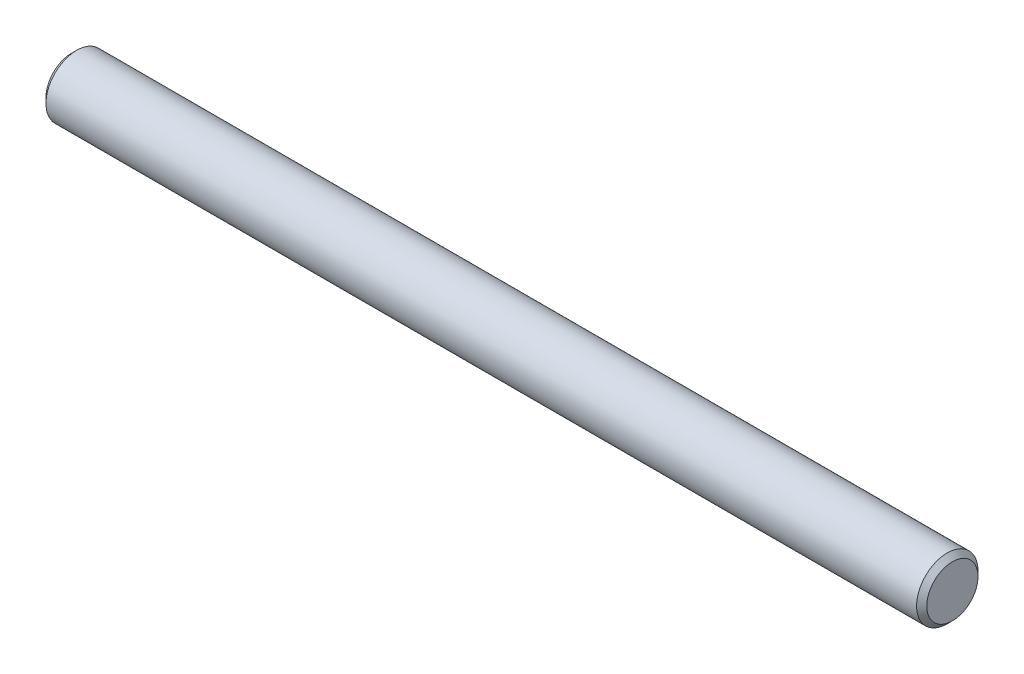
from build123d import *

# Parameters (mm, degrees)
SKETCH1_R      = 6
EXTRUDE1_DEPTH = 172
CHAMFER1_SIZE  = 1


with BuildPart() as part:
    # Sketch1 → Extrude1 (new body)
    with BuildSketch(Plane(origin=(0, 0, 0), x_dir=(0, 0, -1), z_dir=(1, 0, 0))):
        Circle(SKETCH1_R)
    extrude(amount=EXTRUDE1_DEPTH)

    # Chamfer1
    chamfer1_edges = [part.edges().sort_by_distance(p)[0] for p in [
        (0, 0, 6),
        (172, 0, 6),
    ]]
    chamfer(chamfer1_edges, length=CHAMFER1_SIZE)


solid = part.part
